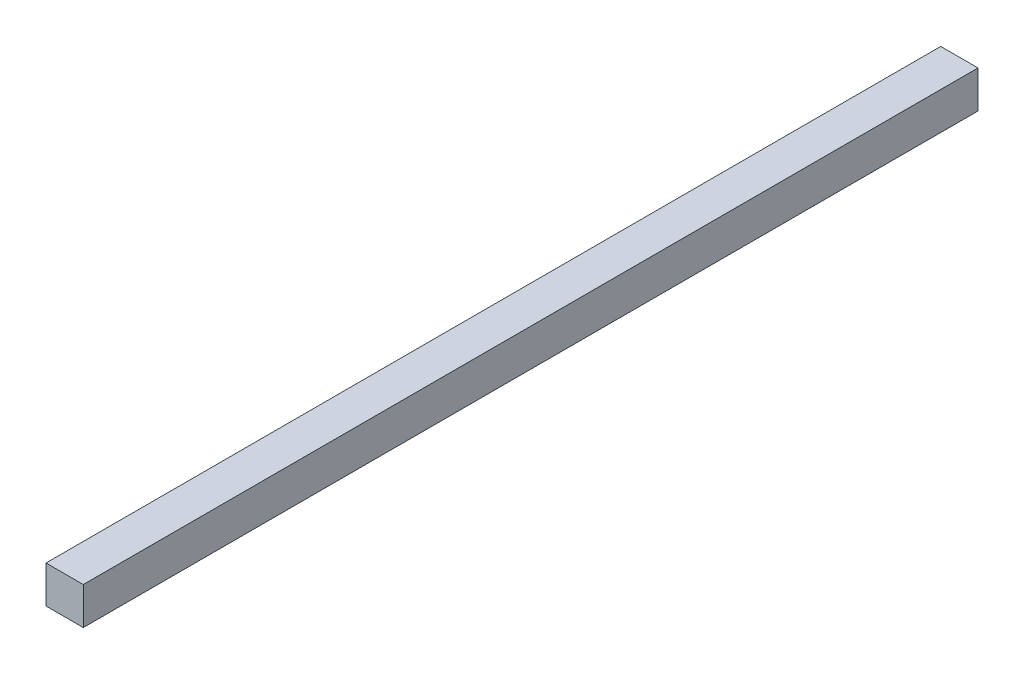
from build123d import *

# Parameters (mm, degrees)
SKETCH1_W      = 6.35
SKETCH1_H      = 6.35
EXTRUDE1_DEPTH = 152.4


with BuildPart() as part:
    # Sketch1 → Extrude1 (new body)
    with BuildSketch(Plane.XY):
        with Locations((3.175, 3.175)):
            Rectangle(SKETCH1_W, SKETCH1_H)
    extrude(amount=EXTRUDE1_DEPTH)


solid = part.part
